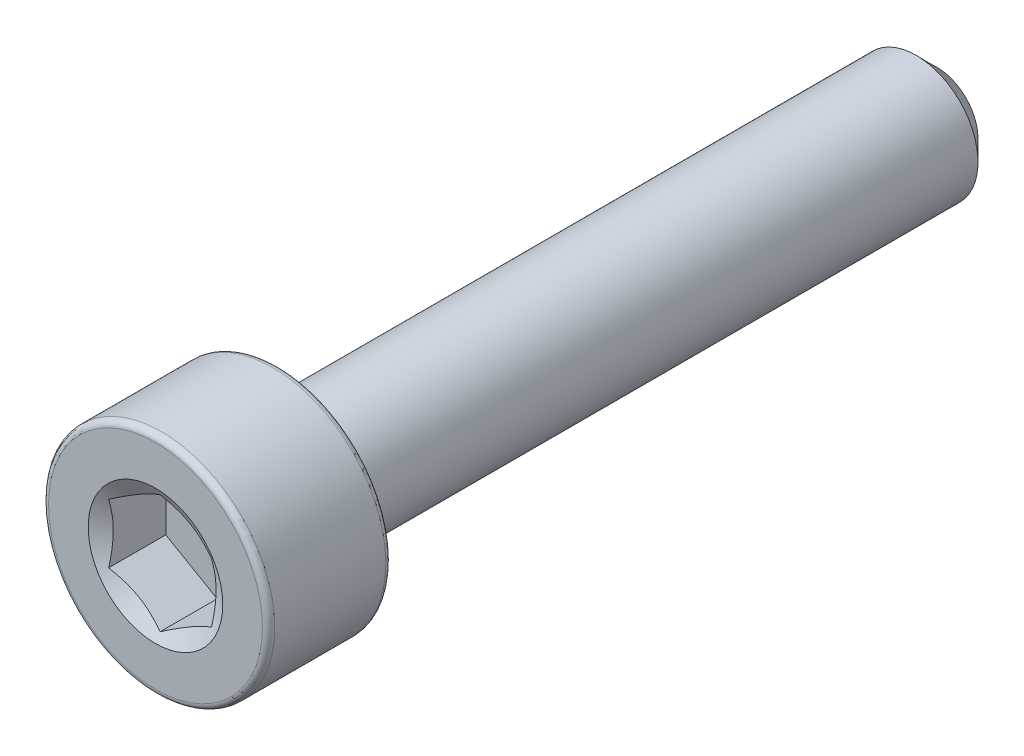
ISO-10303-21;
HEADER;
FILE_DESCRIPTION(('STEP AP214'),'2;1');
FILE_NAME('part.step','',(''),(''),'','','');
FILE_SCHEMA(('AUTOMOTIVE_DESIGN { 1 0 10303 214 1 1 1 1 }'));
ENDSEC;
DATA;
#1=APPLICATION_CONTEXT('core data for automotive mechanical design processes');
#2=APPLICATION_PROTOCOL_DEFINITION('international standard','automotive_design',2000,#1);
#3=PRODUCT_CONTEXT('',#1,'mechanical');
#4=PRODUCT('Part','Part','',(#3));
#5=PRODUCT_RELATED_PRODUCT_CATEGORY('part','',(#4));
#6=PRODUCT_DEFINITION_FORMATION('','',#4);
#7=PRODUCT_DEFINITION_CONTEXT('part definition',#1,'design');
#8=PRODUCT_DEFINITION('design','',#6,#7);
#9=PRODUCT_DEFINITION_SHAPE('','',#8);
#10=(LENGTH_UNIT() NAMED_UNIT(*) SI_UNIT(.MILLI.,.METRE.));
#11=(NAMED_UNIT(*) PLANE_ANGLE_UNIT() SI_UNIT($,.RADIAN.));
#12=(NAMED_UNIT(*) SI_UNIT($,.STERADIAN.) SOLID_ANGLE_UNIT());
#13=UNCERTAINTY_MEASURE_WITH_UNIT(LENGTH_MEASURE(1.E-05),#10,'distance_accuracy_value','');
#14=(GEOMETRIC_REPRESENTATION_CONTEXT(3) GLOBAL_UNCERTAINTY_ASSIGNED_CONTEXT((#13)) GLOBAL_UNIT_ASSIGNED_CONTEXT((#10,
#11,#12)) REPRESENTATION_CONTEXT('',''));
#15=CARTESIAN_POINT('',(0.,0.,0.));
#16=DIRECTION('',(0.,0.,1.));
#17=DIRECTION('',(1.,0.,0.));
#18=AXIS2_PLACEMENT_3D('',#15,#16,#17);
#19=CARTESIAN_POINT('',(0.,0.,-9.5));
#20=DIRECTION('',(0.,0.,-1.));
#21=DIRECTION('',(-1.,0.,0.));
#22=AXIS2_PLACEMENT_3D('',#19,#20,#21);
#23=PLANE('',#22);
#24=CARTESIAN_POINT('',(0.,0.,-9.5));
#25=DIRECTION('',(0.,0.,-1.));
#26=DIRECTION('',(-1.,0.,0.));
#27=AXIS2_PLACEMENT_3D('',#24,#25,#26);
#28=CIRCLE('',#27,1.);
#29=CARTESIAN_POINT('',(-1.,0.,-9.5));
#30=VERTEX_POINT('',#29);
#31=EDGE_CURVE('E52',#30,#30,#28,.T.);
#32=ORIENTED_EDGE('',*,*,#31,.T.);
#33=EDGE_LOOP('',(#32));
#34=FACE_BOUND('',#33,.T.);
#35=ADVANCED_FACE('F39',(#34),#23,.T.);
#36=CARTESIAN_POINT('',(0.,0.,-9.5));
#37=DIRECTION('',(0.,0.,1.));
#38=DIRECTION('',(1.,0.,0.));
#39=AXIS2_PLACEMENT_3D('',#36,#37,#38);
#40=CONICAL_SURFACE('',#39,1.,0.785398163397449);
#41=CARTESIAN_POINT('',(0.,0.,-9.));
#42=DIRECTION('',(0.,0.,-1.));
#43=DIRECTION('',(-1.,0.,0.));
#44=AXIS2_PLACEMENT_3D('',#41,#42,#43);
#45=CIRCLE('',#44,1.50000000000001);
#46=CARTESIAN_POINT('',(-1.50000000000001,0.,-9.));
#47=VERTEX_POINT('',#46);
#48=EDGE_CURVE('E137',#47,#47,#45,.T.);
#49=ORIENTED_EDGE('',*,*,#48,.T.);
#50=EDGE_LOOP('',(#49));
#51=FACE_BOUND('',#50,.T.);
#52=ORIENTED_EDGE('',*,*,#31,.F.);
#53=EDGE_LOOP('',(#52));
#54=FACE_BOUND('',#53,.T.);
#55=ADVANCED_FACE('F143',(#51,#54),#40,.T.);
#56=CARTESIAN_POINT('',(0.,0.,-9.5));
#57=DIRECTION('',(0.,0.,-1.));
#58=DIRECTION('',(-1.,0.,0.));
#59=AXIS2_PLACEMENT_3D('',#56,#57,#58);
#60=CYLINDRICAL_SURFACE('',#59,1.50000000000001);
#61=CARTESIAN_POINT('',(0.,0.,6.5));
#62=DIRECTION('',(0.,0.,-1.));
#63=DIRECTION('',(-1.,0.,0.));
#64=AXIS2_PLACEMENT_3D('',#61,#62,#63);
#65=CIRCLE('',#64,1.5);
#66=CARTESIAN_POINT('',(-1.5,0.,6.5));
#67=VERTEX_POINT('',#66);
#68=EDGE_CURVE('E134',#67,#67,#65,.T.);
#69=ORIENTED_EDGE('',*,*,#68,.T.);
#70=EDGE_LOOP('',(#69));
#71=FACE_BOUND('',#70,.T.);
#72=ORIENTED_EDGE('',*,*,#48,.F.);
#73=EDGE_LOOP('',(#72));
#74=FACE_BOUND('',#73,.T.);
#75=ADVANCED_FACE('F145',(#71,#74),#60,.T.);
#76=CARTESIAN_POINT('',(0.,1.5,6.5));
#77=DIRECTION('',(0.,0.,-1.));
#78=DIRECTION('',(-1.,0.,0.));
#79=AXIS2_PLACEMENT_3D('',#76,#77,#78);
#80=PLANE('',#79);
#81=CARTESIAN_POINT('',(0.,0.,6.5));
#82=DIRECTION('',(0.,0.,-1.));
#83=DIRECTION('',(-1.,0.,0.));
#84=AXIS2_PLACEMENT_3D('',#81,#82,#83);
#85=CIRCLE('',#84,2.6);
#86=CARTESIAN_POINT('',(-2.6,0.,6.5));
#87=VERTEX_POINT('',#86);
#88=EDGE_CURVE('E131',#87,#87,#85,.T.);
#89=ORIENTED_EDGE('',*,*,#88,.T.);
#90=EDGE_LOOP('',(#89));
#91=FACE_BOUND('',#90,.T.);
#92=ORIENTED_EDGE('',*,*,#68,.F.);
#93=EDGE_LOOP('',(#92));
#94=FACE_BOUND('',#93,.T.);
#95=ADVANCED_FACE('F151',(#91,#94),#80,.T.);
#96=CARTESIAN_POINT('',(0.,0.,6.65));
#97=DIRECTION('',(0.,0.,-1.));
#98=DIRECTION('',(-1.,0.,0.));
#99=AXIS2_PLACEMENT_3D('',#96,#97,#98);
#100=TOROIDAL_SURFACE('',#99,2.6,0.15);
#101=CARTESIAN_POINT('',(0.,0.,6.65));
#102=DIRECTION('',(0.,0.,-1.));
#103=DIRECTION('',(-1.,0.,0.));
#104=AXIS2_PLACEMENT_3D('',#101,#102,#103);
#105=CIRCLE('',#104,2.75);
#106=CARTESIAN_POINT('',(-2.75,0.,6.65));
#107=VERTEX_POINT('',#106);
#108=EDGE_CURVE('E128',#107,#107,#105,.T.);
#109=ORIENTED_EDGE('',*,*,#108,.T.);
#110=EDGE_LOOP('',(#109));
#111=FACE_BOUND('',#110,.T.);
#112=ORIENTED_EDGE('',*,*,#88,.F.);
#113=EDGE_LOOP('',(#112));
#114=FACE_BOUND('',#113,.T.);
#115=ADVANCED_FACE('F157',(#111,#114),#100,.T.);
#116=CARTESIAN_POINT('',(0.,0.,-9.5));
#117=DIRECTION('',(0.,0.,-1.));
#118=DIRECTION('',(-1.,0.,0.));
#119=AXIS2_PLACEMENT_3D('',#116,#117,#118);
#120=CYLINDRICAL_SURFACE('',#119,2.75);
#121=CARTESIAN_POINT('',(0.,0.,9.35));
#122=DIRECTION('',(0.,0.,-1.));
#123=DIRECTION('',(-1.,0.,0.));
#124=AXIS2_PLACEMENT_3D('',#121,#122,#123);
#125=CIRCLE('',#124,2.75);
#126=CARTESIAN_POINT('',(-2.75,0.,9.35));
#127=VERTEX_POINT('',#126);
#128=EDGE_CURVE('E125',#127,#127,#125,.T.);
#129=ORIENTED_EDGE('',*,*,#128,.T.);
#130=EDGE_LOOP('',(#129));
#131=FACE_BOUND('',#130,.T.);
#132=ORIENTED_EDGE('',*,*,#108,.F.);
#133=EDGE_LOOP('',(#132));
#134=FACE_BOUND('',#133,.T.);
#135=ADVANCED_FACE('F161',(#131,#134),#120,.T.);
#136=CARTESIAN_POINT('',(0.,0.,9.35));
#137=DIRECTION('',(0.,0.,-1.));
#138=DIRECTION('',(-1.,0.,0.));
#139=AXIS2_PLACEMENT_3D('',#136,#137,#138);
#140=TOROIDAL_SURFACE('',#139,2.6,0.15);
#141=CARTESIAN_POINT('',(0.,0.,9.5));
#142=DIRECTION('',(0.,0.,-1.));
#143=DIRECTION('',(-1.,0.,0.));
#144=AXIS2_PLACEMENT_3D('',#141,#142,#143);
#145=CIRCLE('',#144,2.6);
#146=CARTESIAN_POINT('',(-2.6,0.,9.5));
#147=VERTEX_POINT('',#146);
#148=EDGE_CURVE('E122',#147,#147,#145,.T.);
#149=ORIENTED_EDGE('',*,*,#148,.T.);
#150=EDGE_LOOP('',(#149));
#151=FACE_BOUND('',#150,.T.);
#152=ORIENTED_EDGE('',*,*,#128,.F.);
#153=EDGE_LOOP('',(#152));
#154=FACE_BOUND('',#153,.T.);
#155=ADVANCED_FACE('F165',(#151,#154),#140,.T.);
#156=CARTESIAN_POINT('',(0.,2.6,9.5));
#157=DIRECTION('',(0.,0.,1.));
#158=DIRECTION('',(1.,0.,0.));
#159=AXIS2_PLACEMENT_3D('',#156,#157,#158);
#160=PLANE('',#159);
#161=CARTESIAN_POINT('',(0.,0.,9.5));
#162=DIRECTION('',(0.,0.,1.));
#163=DIRECTION('',(1.,0.,0.));
#164=AXIS2_PLACEMENT_3D('',#161,#162,#163);
#165=CIRCLE('',#164,1.63614639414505);
#166=CARTESIAN_POINT('',(1.63614639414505,0.,9.5));
#167=VERTEX_POINT('',#166);
#168=EDGE_CURVE('E259',#167,#167,#165,.T.);
#169=ORIENTED_EDGE('',*,*,#168,.F.);
#170=EDGE_LOOP('',(#169));
#171=FACE_BOUND('',#170,.T.);
#172=ORIENTED_EDGE('',*,*,#148,.F.);
#173=EDGE_LOOP('',(#172));
#174=FACE_BOUND('',#173,.T.);
#175=ADVANCED_FACE('F169',(#171,#174),#160,.T.);
#176=CARTESIAN_POINT('',(0.,0.,9.5));
#177=DIRECTION('',(0.,0.,1.));
#178=DIRECTION('',(1.,0.,0.));
#179=AXIS2_PLACEMENT_3D('',#176,#177,#178);
#180=CONICAL_SURFACE('',#179,1.63614639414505,1.0471975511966);
#181=ORIENTED_EDGE('',*,*,#168,.T.);
#182=EDGE_LOOP('',(#181));
#183=FACE_BOUND('',#182,.T.);
#184=CARTESIAN_POINT('',(1.2502,0.721572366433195,9.38877044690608));
#185=CARTESIAN_POINT('',(1.19526669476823,0.75328812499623,9.37044968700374));
#186=CARTESIAN_POINT('',(1.13985921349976,0.785277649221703,9.35378707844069));
#187=CARTESIAN_POINT('',(1.02808463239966,0.849810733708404,9.32470107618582));
#188=CARTESIAN_POINT('',(0.971715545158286,0.882355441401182,9.3122879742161));
#189=CARTESIAN_POINT('',(0.859676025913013,0.947041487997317,9.29296345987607));
#190=CARTESIAN_POINT('',(0.804022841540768,0.979172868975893,9.28592346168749));
#191=CARTESIAN_POINT('',(0.692454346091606,1.04358696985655,9.27751620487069));
#192=CARTESIAN_POINT('',(0.636539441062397,1.07586945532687,9.27614198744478));
#193=CARTESIAN_POINT('',(0.532042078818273,1.13620103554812,9.27898710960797));
#194=CARTESIAN_POINT('',(0.483444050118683,1.16425912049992,9.28250787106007));
#195=CARTESIAN_POINT('',(0.386564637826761,1.22019247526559,9.29367088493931));
#196=CARTESIAN_POINT('',(0.338283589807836,1.24806755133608,9.30131695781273));
#197=CARTESIAN_POINT('',(0.241204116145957,1.30411641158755,9.32043322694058));
#198=CARTESIAN_POINT('',(0.192417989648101,1.3322830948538,9.33198452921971));
#199=CARTESIAN_POINT('',(0.0955737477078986,1.38819614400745,9.35820208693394));
#200=CARTESIAN_POINT('',(0.0475143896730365,1.41594322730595,9.37286217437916));
#201=CARTESIAN_POINT('',(-0.000199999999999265,1.4434911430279,9.38877044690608));
#202=B_SPLINE_CURVE_WITH_KNOTS('',3,(#184,#185,#186,#187,#188,#189,#190,#191,#192,#193,#194,
#195,#196,#197,#198,#199,#200,#201),.UNSPECIFIED.,.F.,.F.,(4,2,2,2,2,2,2,2,4),(0.,
0.198150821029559,0.39677819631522,0.590488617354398,0.78396104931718,0.952480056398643,
1.12115539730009,1.29357430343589,1.4656542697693),.UNSPECIFIED.);
#203=CARTESIAN_POINT('',(1.25,0.721687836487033,9.38870377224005));
#204=VERTEX_POINT('',#203);
#205=CARTESIAN_POINT('',(0.,1.44337567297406,9.38870377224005));
#206=VERTEX_POINT('',#205);
#207=EDGE_CURVE('E106',#204,#206,#202,.T.);
#208=ORIENTED_EDGE('',*,*,#207,.F.);
#209=CARTESIAN_POINT('',(1.25,-1.89493751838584,9.86600491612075));
#210=CARTESIAN_POINT('',(1.25,-1.8406706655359,9.83985913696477));
#211=CARTESIAN_POINT('',(1.25,-1.78627450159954,9.81397718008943));
#212=CARTESIAN_POINT('',(1.25,-1.67715428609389,9.76289014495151));
#213=CARTESIAN_POINT('',(1.25,-1.62243018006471,9.73768518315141));
#214=CARTESIAN_POINT('',(1.25,-1.5122815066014,9.68796514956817));
#215=CARTESIAN_POINT('',(1.25,-1.45685471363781,9.66345498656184));
#216=CARTESIAN_POINT('',(1.25,-1.34554530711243,9.61549912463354));
#217=CARTESIAN_POINT('',(1.25,-1.28966271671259,9.59205337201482));
#218=CARTESIAN_POINT('',(1.25,-1.17576624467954,9.5458644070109));
#219=CARTESIAN_POINT('',(1.25,-1.11773662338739,9.52315949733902));
#220=CARTESIAN_POINT('',(1.25,-1.00099484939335,9.4795841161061));
#221=CARTESIAN_POINT('',(1.25,-0.942282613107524,9.45871387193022));
#222=CARTESIAN_POINT('',(1.25,-0.765204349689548,9.39970721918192));
#223=CARTESIAN_POINT('',(1.25,-0.645583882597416,9.36504221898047));
#224=CARTESIAN_POINT('',(1.25,-0.463875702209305,9.32448382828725));
#225=CARTESIAN_POINT('',(1.25,-0.403068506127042,9.31288446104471));
#226=CARTESIAN_POINT('',(1.25,-0.280742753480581,9.29425184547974));
#227=CARTESIAN_POINT('',(1.25,-0.219224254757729,9.28721822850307));
#228=CARTESIAN_POINT('',(1.25,-0.0965698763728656,9.27836802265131));
#229=CARTESIAN_POINT('',(1.25,-0.0354387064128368,9.27648784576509));
#230=CARTESIAN_POINT('',(1.25,0.0867606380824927,9.27793281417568));
#231=CARTESIAN_POINT('',(1.25,0.147828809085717,9.28125823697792));
#232=CARTESIAN_POINT('',(1.25,0.296976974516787,9.29544420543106));
#233=CARTESIAN_POINT('',(1.25,0.384798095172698,9.30902990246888));
#234=CARTESIAN_POINT('',(1.25,0.558777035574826,9.34447190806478));
#235=CARTESIAN_POINT('',(1.25,0.64493277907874,9.36633791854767));
#236=CARTESIAN_POINT('',(1.25,0.773809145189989,9.40387295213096));
#237=CARTESIAN_POINT('',(1.25,0.81719238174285,9.41735279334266));
#238=CARTESIAN_POINT('',(1.25,0.903507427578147,9.44560647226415));
#239=CARTESIAN_POINT('',(1.25,0.946439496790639,9.4603795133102));
#240=CARTESIAN_POINT('',(1.25,1.0319081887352,9.49100070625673));
#241=CARTESIAN_POINT('',(1.25,1.07444487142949,9.50684869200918));
#242=CARTESIAN_POINT('',(1.25,1.1591793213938,9.53944353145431));
#243=CARTESIAN_POINT('',(1.25,1.20137703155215,9.55619053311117));
#244=CARTESIAN_POINT('',(1.25,1.31147066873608,9.6010154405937));
#245=CARTESIAN_POINT('',(1.25,1.37912101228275,9.62969595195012));
#246=CARTESIAN_POINT('',(1.25,1.51378271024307,9.68852402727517));
#247=CARTESIAN_POINT('',(1.25,1.58079400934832,9.71867171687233));
#248=CARTESIAN_POINT('',(1.25,1.78108956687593,9.81078601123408));
#249=CARTESIAN_POINT('',(1.25,1.91360872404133,9.87441259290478));
#250=CARTESIAN_POINT('',(1.25,2.1774904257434,10.0044258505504));
#251=CARTESIAN_POINT('',(1.25,2.30885117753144,10.0708161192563));
#252=CARTESIAN_POINT('',(1.25,2.57065126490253,10.2053391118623));
#253=CARTESIAN_POINT('',(1.25,2.70109073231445,10.2734715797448));
#254=CARTESIAN_POINT('',(1.25,2.94850263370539,10.4041482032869));
#255=CARTESIAN_POINT('',(1.25,3.06553428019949,10.4665806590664));
#256=CARTESIAN_POINT('',(1.25,3.29922001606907,10.5921595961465));
#257=CARTESIAN_POINT('',(1.25,3.41587408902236,10.6553061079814));
#258=CARTESIAN_POINT('',(1.25,3.64856969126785,10.7819563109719));
#259=CARTESIAN_POINT('',(1.25,3.76461202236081,10.8454585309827));
#260=CARTESIAN_POINT('',(1.25,3.99646186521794,10.972874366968));
#261=CARTESIAN_POINT('',(1.25,4.11226939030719,11.0367879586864));
#262=CARTESIAN_POINT('',(1.25,4.22799321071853,11.1008518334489));
#263=B_SPLINE_CURVE_WITH_KNOTS('',3,(#209,#210,#211,#212,#213,#214,#215,#216,#217,#218,#219,
#220,#221,#222,#223,#224,#225,#226,#227,#228,#229,#230,#231,#232,#233,#234,#235,#236,#237,#238,
#239,#240,#241,#242,#243,#244,#245,#246,#247,#248,#249,#250,#251,#252,#253,#254,#255,#256,#257,
#258,#259,#260,#261,#262),.UNSPECIFIED.,.F.,.F.,(4,2,2,2,2,2,2,2,2,2,2,2,2,2,2,2,2,2,2,2,2,2,2,
2,2,2,4),(0.,0.180713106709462,0.361457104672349,0.543260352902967,0.725054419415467,
0.911961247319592,1.09889120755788,1.47173308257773,1.65730634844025,1.84286462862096,
2.02612278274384,2.20939070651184,2.47544204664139,2.74180608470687,2.87807807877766,
3.0142667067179,3.15043433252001,3.28662443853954,3.50703539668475,3.7274652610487,
4.16841202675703,4.60995110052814,5.05142565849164,5.44935247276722,5.84729636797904,
6.24413951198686,6.6409594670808),.UNSPECIFIED.);
#264=CARTESIAN_POINT('',(1.25,-0.721687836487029,9.38870377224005));
#265=VERTEX_POINT('',#264);
#266=EDGE_CURVE('E215',#265,#204,#263,.T.);
#267=ORIENTED_EDGE('',*,*,#266,.F.);
#268=CARTESIAN_POINT('',(-0.000200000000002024,-1.4434911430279,9.38877044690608));
#269=CARTESIAN_POINT('',(0.0547333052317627,-1.41177538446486,9.37044968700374));
#270=CARTESIAN_POINT('',(0.110140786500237,-1.37978586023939,9.35378707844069));
#271=CARTESIAN_POINT('',(0.221915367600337,-1.31525277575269,9.32470107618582));
#272=CARTESIAN_POINT('',(0.278284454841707,-1.28270806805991,9.3122879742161));
#273=CARTESIAN_POINT('',(0.390323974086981,-1.21802202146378,9.29296345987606));
#274=CARTESIAN_POINT('',(0.445977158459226,-1.1858906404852,9.28592346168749));
#275=CARTESIAN_POINT('',(0.557545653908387,-1.12147653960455,9.27751620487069));
#276=CARTESIAN_POINT('',(0.613460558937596,-1.08919405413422,9.27614198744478));
#277=CARTESIAN_POINT('',(0.71795792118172,-1.02886247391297,9.27898710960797));
#278=CARTESIAN_POINT('',(0.766555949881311,-1.00080438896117,9.28250787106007));
#279=CARTESIAN_POINT('',(0.863435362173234,-0.9448710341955,9.29367088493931));
#280=CARTESIAN_POINT('',(0.911716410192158,-0.916995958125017,9.30131695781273));
#281=CARTESIAN_POINT('',(1.00879588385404,-0.860947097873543,9.32043322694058));
#282=CARTESIAN_POINT('',(1.05758201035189,-0.832780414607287,9.33198452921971));
#283=CARTESIAN_POINT('',(1.1544262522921,-0.776867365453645,9.35820208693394));
#284=CARTESIAN_POINT('',(1.20248561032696,-0.749120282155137,9.37286217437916));
#285=CARTESIAN_POINT('',(1.2502,-0.721572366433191,9.38877044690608));
#286=B_SPLINE_CURVE_WITH_KNOTS('',3,(#268,#269,#270,#271,#272,#273,#274,#275,#276,#277,#278,
#279,#280,#281,#282,#283,#284,#285),.UNSPECIFIED.,.F.,.F.,(4,2,2,2,2,2,2,2,4),(0.,
0.198150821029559,0.39677819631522,0.590488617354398,0.783961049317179,0.952480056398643,
1.12115539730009,1.2935743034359,1.4656542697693),.UNSPECIFIED.);
#287=CARTESIAN_POINT('',(0.,-1.44337567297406,9.38870377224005));
#288=VERTEX_POINT('',#287);
#289=EDGE_CURVE('E209',#288,#265,#286,.T.);
#290=ORIENTED_EDGE('',*,*,#289,.F.);
#291=CARTESIAN_POINT('',(-1.2502,-0.721572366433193,9.38877044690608));
#292=CARTESIAN_POINT('',(-1.19526669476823,-0.753288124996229,9.37044968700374));
#293=CARTESIAN_POINT('',(-1.13985921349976,-0.785277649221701,9.35378707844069));
#294=CARTESIAN_POINT('',(-1.02808463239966,-0.849810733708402,9.32470107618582));
#295=CARTESIAN_POINT('',(-0.971715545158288,-0.88235544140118,9.3122879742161));
#296=CARTESIAN_POINT('',(-0.859676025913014,-0.947041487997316,9.29296345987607));
#297=CARTESIAN_POINT('',(-0.804022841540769,-0.979172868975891,9.28592346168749));
#298=CARTESIAN_POINT('',(-0.692454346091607,-1.04358696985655,9.27751620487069));
#299=CARTESIAN_POINT('',(-0.636539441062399,-1.07586945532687,9.27614198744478));
#300=CARTESIAN_POINT('',(-0.532042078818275,-1.13620103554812,9.27898710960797));
#301=CARTESIAN_POINT('',(-0.483444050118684,-1.16425912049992,9.28250787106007));
#302=CARTESIAN_POINT('',(-0.386564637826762,-1.22019247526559,9.29367088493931));
#303=CARTESIAN_POINT('',(-0.338283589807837,-1.24806755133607,9.30131695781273));
#304=CARTESIAN_POINT('',(-0.241204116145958,-1.30411641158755,9.32043322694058));
#305=CARTESIAN_POINT('',(-0.192417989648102,-1.3322830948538,9.33198452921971));
#306=CARTESIAN_POINT('',(-0.0955737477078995,-1.38819614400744,9.35820208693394));
#307=CARTESIAN_POINT('',(-0.0475143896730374,-1.41594322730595,9.37286217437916));
#308=CARTESIAN_POINT('',(0.000199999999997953,-1.4434911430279,9.38877044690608));
#309=B_SPLINE_CURVE_WITH_KNOTS('',3,(#291,#292,#293,#294,#295,#296,#297,#298,#299,#300,#301,
#302,#303,#304,#305,#306,#307,#308),.UNSPECIFIED.,.F.,.F.,(4,2,2,2,2,2,2,2,4),(0.,
0.198150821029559,0.39677819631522,0.590488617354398,0.783961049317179,0.952480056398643,
1.12115539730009,1.29357430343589,1.4656542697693),.UNSPECIFIED.);
#310=CARTESIAN_POINT('',(-1.25,-0.721687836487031,9.38870377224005));
#311=VERTEX_POINT('',#310);
#312=EDGE_CURVE('E59',#311,#288,#309,.T.);
#313=ORIENTED_EDGE('',*,*,#312,.F.);
#314=CARTESIAN_POINT('',(-1.25,-1.89493751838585,9.86600491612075));
#315=CARTESIAN_POINT('',(-1.25,-1.8406706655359,9.83985913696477));
#316=CARTESIAN_POINT('',(-1.25,-1.78627450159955,9.81397718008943));
#317=CARTESIAN_POINT('',(-1.25,-1.6771542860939,9.76289014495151));
#318=CARTESIAN_POINT('',(-1.25,-1.62243018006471,9.73768518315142));
#319=CARTESIAN_POINT('',(-1.25,-1.51228150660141,9.68796514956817));
#320=CARTESIAN_POINT('',(-1.25,-1.45685471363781,9.66345498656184));
#321=CARTESIAN_POINT('',(-1.25,-1.34554530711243,9.61549912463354));
#322=CARTESIAN_POINT('',(-1.25,-1.28966271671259,9.59205337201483));
#323=CARTESIAN_POINT('',(-1.25,-1.17576624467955,9.5458644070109));
#324=CARTESIAN_POINT('',(-1.25,-1.11773662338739,9.52315949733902));
#325=CARTESIAN_POINT('',(-1.25,-1.00099484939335,9.4795841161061));
#326=CARTESIAN_POINT('',(-1.25,-0.942282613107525,9.45871387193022));
#327=CARTESIAN_POINT('',(-1.25,-0.765204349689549,9.39970721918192));
#328=CARTESIAN_POINT('',(-1.25,-0.645583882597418,9.36504221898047));
#329=CARTESIAN_POINT('',(-1.25,-0.463875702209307,9.32448382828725));
#330=CARTESIAN_POINT('',(-1.25,-0.403068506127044,9.31288446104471));
#331=CARTESIAN_POINT('',(-1.25,-0.280742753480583,9.29425184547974));
#332=CARTESIAN_POINT('',(-1.25,-0.219224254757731,9.28721822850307));
#333=CARTESIAN_POINT('',(-1.25,-0.0965698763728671,9.27836802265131));
#334=CARTESIAN_POINT('',(-1.25,-0.0354387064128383,9.27648784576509));
#335=CARTESIAN_POINT('',(-1.25,0.0867606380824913,9.27793281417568));
#336=CARTESIAN_POINT('',(-1.25,0.147828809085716,9.28125823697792));
#337=CARTESIAN_POINT('',(-1.25,0.296976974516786,9.29544420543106));
#338=CARTESIAN_POINT('',(-1.25,0.384798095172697,9.30902990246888));
#339=CARTESIAN_POINT('',(-1.25,0.558777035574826,9.34447190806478));
#340=CARTESIAN_POINT('',(-1.25,0.644932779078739,9.36633791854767));
#341=CARTESIAN_POINT('',(-1.25,0.773809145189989,9.40387295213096));
#342=CARTESIAN_POINT('',(-1.25,0.817192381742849,9.41735279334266));
#343=CARTESIAN_POINT('',(-1.25,0.903507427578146,9.44560647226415));
#344=CARTESIAN_POINT('',(-1.25,0.946439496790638,9.4603795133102));
#345=CARTESIAN_POINT('',(-1.25,1.0319081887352,9.49100070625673));
#346=CARTESIAN_POINT('',(-1.25,1.07444487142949,9.50684869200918));
#347=CARTESIAN_POINT('',(-1.25,1.1591793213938,9.53944353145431));
#348=CARTESIAN_POINT('',(-1.25,1.20137703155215,9.55619053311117));
#349=CARTESIAN_POINT('',(-1.25,1.31147066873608,9.6010154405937));
#350=CARTESIAN_POINT('',(-1.25,1.37912101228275,9.62969595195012));
#351=CARTESIAN_POINT('',(-1.25,1.51378271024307,9.68852402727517));
#352=CARTESIAN_POINT('',(-1.25,1.58079400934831,9.71867171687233));
#353=CARTESIAN_POINT('',(-1.25,1.78108956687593,9.81078601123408));
#354=CARTESIAN_POINT('',(-1.25,1.91360872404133,9.87441259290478));
#355=CARTESIAN_POINT('',(-1.25,2.1774904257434,10.0044258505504));
#356=CARTESIAN_POINT('',(-1.25,2.30885117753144,10.0708161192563));
#357=CARTESIAN_POINT('',(-1.25,2.57065126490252,10.2053391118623));
#358=CARTESIAN_POINT('',(-1.25,2.70109073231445,10.2734715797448));
#359=CARTESIAN_POINT('',(-1.25,2.94850263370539,10.4041482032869));
#360=CARTESIAN_POINT('',(-1.25,3.06553428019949,10.4665806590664));
#361=CARTESIAN_POINT('',(-1.25,3.29922001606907,10.5921595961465));
#362=CARTESIAN_POINT('',(-1.25,3.41587408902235,10.6553061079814));
#363=CARTESIAN_POINT('',(-1.25,3.64856969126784,10.7819563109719));
#364=CARTESIAN_POINT('',(-1.25,3.76461202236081,10.8454585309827));
#365=CARTESIAN_POINT('',(-1.25,3.99646186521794,10.972874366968));
#366=CARTESIAN_POINT('',(-1.25,4.11226939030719,11.0367879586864));
#367=CARTESIAN_POINT('',(-1.25,4.22799321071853,11.1008518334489));
#368=B_SPLINE_CURVE_WITH_KNOTS('',3,(#314,#315,#316,#317,#318,#319,#320,#321,#322,#323,#324,
#325,#326,#327,#328,#329,#330,#331,#332,#333,#334,#335,#336,#337,#338,#339,#340,#341,#342,#343,
#344,#345,#346,#347,#348,#349,#350,#351,#352,#353,#354,#355,#356,#357,#358,#359,#360,#361,#362,
#363,#364,#365,#366,#367),.UNSPECIFIED.,.F.,.F.,(4,2,2,2,2,2,2,2,2,2,2,2,2,2,2,2,2,2,2,2,2,2,2,
2,2,2,4),(0.,0.180713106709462,0.361457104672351,0.543260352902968,0.725054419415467,
0.911961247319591,1.09889120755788,1.47173308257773,1.65730634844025,1.84286462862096,
2.02612278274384,2.20939070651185,2.47544204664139,2.74180608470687,2.87807807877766,
3.0142667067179,3.15043433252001,3.28662443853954,3.50703539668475,3.7274652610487,
4.16841202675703,4.60995110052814,5.05142565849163,5.44935247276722,5.84729636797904,
6.24413951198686,6.64095946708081),.UNSPECIFIED.);
#369=CARTESIAN_POINT('',(-1.25,0.721687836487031,9.38870377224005));
#370=VERTEX_POINT('',#369);
#371=EDGE_CURVE('E11',#370,#311,#368,.F.);
#372=ORIENTED_EDGE('',*,*,#371,.F.);
#373=CARTESIAN_POINT('',(0.000200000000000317,1.4434911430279,9.38877044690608));
#374=CARTESIAN_POINT('',(-0.0547333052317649,1.41177538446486,9.37044968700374));
#375=CARTESIAN_POINT('',(-0.110140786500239,1.37978586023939,9.35378707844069));
#376=CARTESIAN_POINT('',(-0.221915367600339,1.31525277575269,9.32470107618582));
#377=CARTESIAN_POINT('',(-0.278284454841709,1.28270806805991,9.3122879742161));
#378=CARTESIAN_POINT('',(-0.390323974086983,1.21802202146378,9.29296345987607));
#379=CARTESIAN_POINT('',(-0.445977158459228,1.1858906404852,9.28592346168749));
#380=CARTESIAN_POINT('',(-0.557545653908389,1.12147653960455,9.27751620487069));
#381=CARTESIAN_POINT('',(-0.613460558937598,1.08919405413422,9.27614198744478));
#382=CARTESIAN_POINT('',(-0.717957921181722,1.02886247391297,9.27898710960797));
#383=CARTESIAN_POINT('',(-0.766555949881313,1.00080438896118,9.28250787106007));
#384=CARTESIAN_POINT('',(-0.863435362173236,0.944871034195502,9.29367088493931));
#385=CARTESIAN_POINT('',(-0.911716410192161,0.916995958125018,9.30131695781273));
#386=CARTESIAN_POINT('',(-1.00879588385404,0.860947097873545,9.32043322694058));
#387=CARTESIAN_POINT('',(-1.0575820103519,0.832780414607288,9.33198452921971));
#388=CARTESIAN_POINT('',(-1.1544262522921,0.776867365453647,9.35820208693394));
#389=CARTESIAN_POINT('',(-1.20248561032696,0.749120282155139,9.37286217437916));
#390=CARTESIAN_POINT('',(-1.2502,0.721572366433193,9.38877044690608));
#391=B_SPLINE_CURVE_WITH_KNOTS('',3,(#373,#374,#375,#376,#377,#378,#379,#380,#381,#382,#383,
#384,#385,#386,#387,#388,#389,#390),.UNSPECIFIED.,.F.,.F.,(4,2,2,2,2,2,2,2,4),(0.,
0.198150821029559,0.396778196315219,0.590488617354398,0.783961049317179,0.952480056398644,
1.12115539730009,1.2935743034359,1.4656542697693),.UNSPECIFIED.);
#392=EDGE_CURVE('E97',#206,#370,#391,.T.);
#393=ORIENTED_EDGE('',*,*,#392,.F.);
#394=EDGE_LOOP('',(#208,#267,#290,#313,#372,#393));
#395=FACE_BOUND('',#394,.T.);
#396=ADVANCED_FACE('F96',(#183,#395),#180,.F.);
#397=CARTESIAN_POINT('',(0.,0.,8.));
#398=DIRECTION('',(0.,0.,1.));
#399=DIRECTION('',(1.,0.,0.));
#400=AXIS2_PLACEMENT_3D('',#397,#398,#399);
#401=PLANE('',#400);
#402=DIRECTION('',(-0.866025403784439,-0.5,0.));
#403=VECTOR('',#402,1.);
#404=CARTESIAN_POINT('',(0.,1.44337567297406,8.));
#405=LINE('',#404,#403);
#406=CARTESIAN_POINT('',(0.,1.44337567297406,8.));
#407=VERTEX_POINT('',#406);
#408=CARTESIAN_POINT('',(-1.25,0.72168783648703,8.));
#409=VERTEX_POINT('',#408);
#410=EDGE_CURVE('E105',#407,#409,#405,.T.);
#411=ORIENTED_EDGE('',*,*,#410,.T.);
#412=DIRECTION('',(0.,-1.,0.));
#413=VECTOR('',#412,1.);
#414=CARTESIAN_POINT('',(-1.25,0.72168783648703,8.));
#415=LINE('',#414,#413);
#416=CARTESIAN_POINT('',(-1.25,-0.721687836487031,8.));
#417=VERTEX_POINT('',#416);
#418=EDGE_CURVE('E110',#409,#417,#415,.T.);
#419=ORIENTED_EDGE('',*,*,#418,.T.);
#420=DIRECTION('',(0.866025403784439,-0.5,0.));
#421=VECTOR('',#420,1.);
#422=CARTESIAN_POINT('',(-1.25,-0.721687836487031,8.));
#423=LINE('',#422,#421);
#424=CARTESIAN_POINT('',(0.,-1.44337567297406,8.));
#425=VERTEX_POINT('',#424);
#426=EDGE_CURVE('E241',#417,#425,#423,.T.);
#427=ORIENTED_EDGE('',*,*,#426,.T.);
#428=DIRECTION('',(0.866025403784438,0.5,0.));
#429=VECTOR('',#428,1.);
#430=CARTESIAN_POINT('',(0.,-1.44337567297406,8.));
#431=LINE('',#430,#429);
#432=CARTESIAN_POINT('',(1.25,-0.721687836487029,8.));
#433=VERTEX_POINT('',#432);
#434=EDGE_CURVE('E245',#425,#433,#431,.T.);
#435=ORIENTED_EDGE('',*,*,#434,.T.);
#436=DIRECTION('',(0.,1.,0.));
#437=VECTOR('',#436,1.);
#438=CARTESIAN_POINT('',(1.25,-0.721687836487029,8.));
#439=LINE('',#438,#437);
#440=CARTESIAN_POINT('',(1.25,0.721687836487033,8.));
#441=VERTEX_POINT('',#440);
#442=EDGE_CURVE('E118',#433,#441,#439,.T.);
#443=ORIENTED_EDGE('',*,*,#442,.T.);
#444=DIRECTION('',(-0.866025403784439,0.5,0.));
#445=VECTOR('',#444,1.);
#446=CARTESIAN_POINT('',(1.25,0.721687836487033,8.));
#447=LINE('',#446,#445);
#448=EDGE_CURVE('E113',#441,#407,#447,.T.);
#449=ORIENTED_EDGE('',*,*,#448,.T.);
#450=EDGE_LOOP('',(#411,#419,#427,#435,#443,#449));
#451=FACE_BOUND('',#450,.T.);
#452=ADVANCED_FACE('F195',(#451),#401,.T.);
#453=CARTESIAN_POINT('',(-1.25,0.72168783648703,8.));
#454=DIRECTION('',(-1.,0.,0.));
#455=DIRECTION('',(0.,-1.,0.));
#456=AXIS2_PLACEMENT_3D('',#453,#454,#455);
#457=PLANE('',#456);
#458=DIRECTION('',(0.,0.,1.));
#459=VECTOR('',#458,1.);
#460=CARTESIAN_POINT('',(-1.25,0.72168783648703,8.));
#461=LINE('',#460,#459);
#462=EDGE_CURVE('E103',#409,#370,#461,.T.);
#463=ORIENTED_EDGE('',*,*,#462,.T.);
#464=ORIENTED_EDGE('',*,*,#371,.T.);
#465=DIRECTION('',(0.,0.,1.));
#466=VECTOR('',#465,1.);
#467=CARTESIAN_POINT('',(-1.25,-0.721687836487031,8.));
#468=LINE('',#467,#466);
#469=EDGE_CURVE('E112',#417,#311,#468,.T.);
#470=ORIENTED_EDGE('',*,*,#469,.F.);
#471=ORIENTED_EDGE('',*,*,#418,.F.);
#472=EDGE_LOOP('',(#463,#464,#470,#471));
#473=FACE_BOUND('',#472,.T.);
#474=ADVANCED_FACE('F108',(#473),#457,.F.);
#475=CARTESIAN_POINT('',(-1.25,-0.721687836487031,8.));
#476=DIRECTION('',(-0.5,-0.866025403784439,0.));
#477=DIRECTION('',(0.866025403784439,-0.5,0.));
#478=AXIS2_PLACEMENT_3D('',#475,#476,#477);
#479=PLANE('',#478);
#480=ORIENTED_EDGE('',*,*,#469,.T.);
#481=ORIENTED_EDGE('',*,*,#312,.T.);
#482=DIRECTION('',(0.,0.,1.));
#483=VECTOR('',#482,1.);
#484=CARTESIAN_POINT('',(0.,-1.44337567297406,8.));
#485=LINE('',#484,#483);
#486=EDGE_CURVE('E115',#425,#288,#485,.T.);
#487=ORIENTED_EDGE('',*,*,#486,.F.);
#488=ORIENTED_EDGE('',*,*,#426,.F.);
#489=EDGE_LOOP('',(#480,#481,#487,#488));
#490=FACE_BOUND('',#489,.T.);
#491=ADVANCED_FACE('F230',(#490),#479,.F.);
#492=CARTESIAN_POINT('',(0.,-1.44337567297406,8.));
#493=DIRECTION('',(0.5,-0.866025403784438,0.));
#494=DIRECTION('',(0.866025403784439,0.5,0.));
#495=AXIS2_PLACEMENT_3D('',#492,#493,#494);
#496=PLANE('',#495);
#497=ORIENTED_EDGE('',*,*,#486,.T.);
#498=ORIENTED_EDGE('',*,*,#289,.T.);
#499=DIRECTION('',(0.,0.,1.));
#500=VECTOR('',#499,1.);
#501=CARTESIAN_POINT('',(1.25,-0.721687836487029,8.));
#502=LINE('',#501,#500);
#503=EDGE_CURVE('E255',#433,#265,#502,.T.);
#504=ORIENTED_EDGE('',*,*,#503,.F.);
#505=ORIENTED_EDGE('',*,*,#434,.F.);
#506=EDGE_LOOP('',(#497,#498,#504,#505));
#507=FACE_BOUND('',#506,.T.);
#508=ADVANCED_FACE('F225',(#507),#496,.F.);
#509=CARTESIAN_POINT('',(1.25,-0.721687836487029,8.));
#510=DIRECTION('',(1.,0.,0.));
#511=DIRECTION('',(0.,0.,-1.));
#512=AXIS2_PLACEMENT_3D('',#509,#510,#511);
#513=PLANE('',#512);
#514=ORIENTED_EDGE('',*,*,#503,.T.);
#515=ORIENTED_EDGE('',*,*,#266,.T.);
#516=DIRECTION('',(0.,0.,1.));
#517=VECTOR('',#516,1.);
#518=CARTESIAN_POINT('',(1.25,0.721687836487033,8.));
#519=LINE('',#518,#517);
#520=EDGE_CURVE('E252',#441,#204,#519,.T.);
#521=ORIENTED_EDGE('',*,*,#520,.F.);
#522=ORIENTED_EDGE('',*,*,#442,.F.);
#523=EDGE_LOOP('',(#514,#515,#521,#522));
#524=FACE_BOUND('',#523,.T.);
#525=ADVANCED_FACE('F222',(#524),#513,.F.);
#526=CARTESIAN_POINT('',(1.25,0.721687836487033,8.));
#527=DIRECTION('',(0.5,0.866025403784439,0.));
#528=DIRECTION('',(-0.866025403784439,0.5,0.));
#529=AXIS2_PLACEMENT_3D('',#526,#527,#528);
#530=PLANE('',#529);
#531=ORIENTED_EDGE('',*,*,#520,.T.);
#532=ORIENTED_EDGE('',*,*,#207,.T.);
#533=DIRECTION('',(0.,0.,1.));
#534=VECTOR('',#533,1.);
#535=CARTESIAN_POINT('',(0.,1.44337567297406,8.));
#536=LINE('',#535,#534);
#537=EDGE_CURVE('E66',#407,#206,#536,.T.);
#538=ORIENTED_EDGE('',*,*,#537,.F.);
#539=ORIENTED_EDGE('',*,*,#448,.F.);
#540=EDGE_LOOP('',(#531,#532,#538,#539));
#541=FACE_BOUND('',#540,.T.);
#542=ADVANCED_FACE('F176',(#541),#530,.F.);
#543=CARTESIAN_POINT('',(0.,1.44337567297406,8.));
#544=DIRECTION('',(-0.5,0.866025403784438,0.));
#545=DIRECTION('',(-0.866025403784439,-0.5,0.));
#546=AXIS2_PLACEMENT_3D('',#543,#544,#545);
#547=PLANE('',#546);
#548=ORIENTED_EDGE('',*,*,#537,.T.);
#549=ORIENTED_EDGE('',*,*,#392,.T.);
#550=ORIENTED_EDGE('',*,*,#462,.F.);
#551=ORIENTED_EDGE('',*,*,#410,.F.);
#552=EDGE_LOOP('',(#548,#549,#550,#551));
#553=FACE_BOUND('',#552,.T.);
#554=ADVANCED_FACE('F102',(#553),#547,.F.);
#555=CLOSED_SHELL('',(#35,#55,#75,#95,#115,#135,#155,#175,#396,#452,#474,#491,#508,#525,#542,#554));
#556=MANIFOLD_SOLID_BREP('B2',#555);
#557=ADVANCED_BREP_SHAPE_REPRESENTATION('',(#18,#556),#14);
#558=SHAPE_DEFINITION_REPRESENTATION(#9,#557);
ENDSEC;
END-ISO-10303-21;
